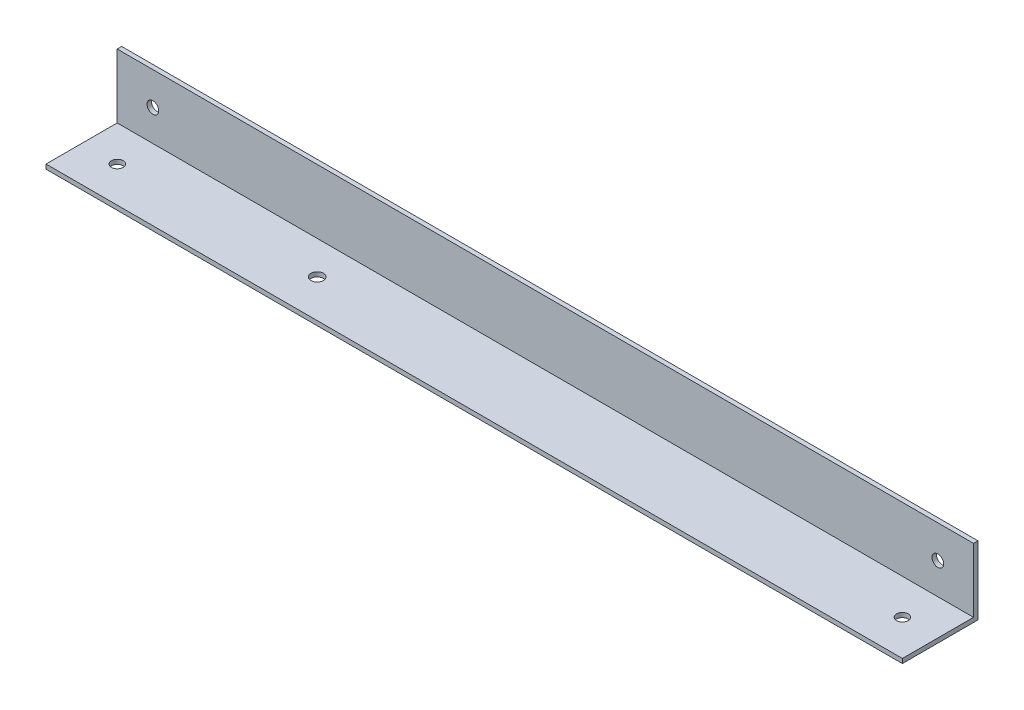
ISO-10303-21;
HEADER;
FILE_DESCRIPTION(('STEP AP214'),'2;1');
FILE_NAME('part.step','',(''),(''),'','','');
FILE_SCHEMA(('AUTOMOTIVE_DESIGN { 1 0 10303 214 1 1 1 1 }'));
ENDSEC;
DATA;
#1=APPLICATION_CONTEXT('core data for automotive mechanical design processes');
#2=APPLICATION_PROTOCOL_DEFINITION('international standard','automotive_design',2000,#1);
#3=PRODUCT_CONTEXT('',#1,'mechanical');
#4=PRODUCT('Part','Part','',(#3));
#5=PRODUCT_RELATED_PRODUCT_CATEGORY('part','',(#4));
#6=PRODUCT_DEFINITION_FORMATION('','',#4);
#7=PRODUCT_DEFINITION_CONTEXT('part definition',#1,'design');
#8=PRODUCT_DEFINITION('design','',#6,#7);
#9=PRODUCT_DEFINITION_SHAPE('','',#8);
#10=(LENGTH_UNIT() NAMED_UNIT(*) SI_UNIT(.MILLI.,.METRE.));
#11=(NAMED_UNIT(*) PLANE_ANGLE_UNIT() SI_UNIT($,.RADIAN.));
#12=(NAMED_UNIT(*) SI_UNIT($,.STERADIAN.) SOLID_ANGLE_UNIT());
#13=UNCERTAINTY_MEASURE_WITH_UNIT(LENGTH_MEASURE(1.E-05),#10,'distance_accuracy_value','');
#14=(GEOMETRIC_REPRESENTATION_CONTEXT(3) GLOBAL_UNCERTAINTY_ASSIGNED_CONTEXT((#13)) GLOBAL_UNIT_ASSIGNED_CONTEXT((#10,
#11,#12)) REPRESENTATION_CONTEXT('',''));
#15=CARTESIAN_POINT('',(0.,0.,0.));
#16=DIRECTION('',(0.,0.,1.));
#17=DIRECTION('',(1.,0.,0.));
#18=AXIS2_PLACEMENT_3D('',#15,#16,#17);
#19=CARTESIAN_POINT('',(0.,0.,26.924));
#20=DIRECTION('',(0.,0.,1.));
#21=DIRECTION('',(1.,0.,0.));
#22=AXIS2_PLACEMENT_3D('',#19,#20,#21);
#23=PLANE('',#22);
#24=DIRECTION('',(1.,0.,0.));
#25=VECTOR('',#24,1.);
#26=CARTESIAN_POINT('',(-209.826086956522,45.0420093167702,26.924));
#27=LINE('',#26,#25);
#28=CARTESIAN_POINT('',(-209.826086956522,45.0420093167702,26.924));
#29=VERTEX_POINT('',#28);
#30=CARTESIAN_POINT('',(94.9739130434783,45.0420093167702,26.924));
#31=VERTEX_POINT('',#30);
#32=EDGE_CURVE('E118',#29,#31,#27,.T.);
#33=ORIENTED_EDGE('',*,*,#32,.F.);
#34=DIRECTION('',(0.,-1.,0.));
#35=VECTOR('',#34,1.);
#36=CARTESIAN_POINT('',(-209.826086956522,67.8385093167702,26.924));
#37=LINE('',#36,#35);
#38=CARTESIAN_POINT('',(-209.826086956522,43.4545093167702,26.924));
#39=VERTEX_POINT('',#38);
#40=EDGE_CURVE('E95',#29,#39,#37,.T.);
#41=ORIENTED_EDGE('',*,*,#40,.T.);
#42=DIRECTION('',(1.,0.,0.));
#43=VECTOR('',#42,1.);
#44=CARTESIAN_POINT('',(-209.826086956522,43.4545093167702,26.924));
#45=LINE('',#44,#43);
#46=CARTESIAN_POINT('',(94.9739130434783,43.4545093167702,26.924));
#47=VERTEX_POINT('',#46);
#48=EDGE_CURVE('E57',#39,#47,#45,.T.);
#49=ORIENTED_EDGE('',*,*,#48,.T.);
#50=DIRECTION('',(0.,1.,0.));
#51=VECTOR('',#50,1.);
#52=CARTESIAN_POINT('',(94.9739130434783,67.8385093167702,26.924));
#53=LINE('',#52,#51);
#54=EDGE_CURVE('E88',#47,#31,#53,.T.);
#55=ORIENTED_EDGE('',*,*,#54,.T.);
#56=EDGE_LOOP('',(#33,#41,#49,#55));
#57=FACE_BOUND('',#56,.T.);
#58=ADVANCED_FACE('F38',(#57),#23,.T.);
#59=CARTESIAN_POINT('',(-209.826086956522,67.8385093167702,26.924));
#60=DIRECTION('',(1.,0.,0.));
#61=DIRECTION('',(0.,0.,-1.));
#62=AXIS2_PLACEMENT_3D('',#59,#60,#61);
#63=PLANE('',#62);
#64=DIRECTION('',(0.,0.,1.));
#65=VECTOR('',#64,1.);
#66=CARTESIAN_POINT('',(-209.826086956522,45.0420093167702,-303.37967743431));
#67=LINE('',#66,#65);
#68=CARTESIAN_POINT('',(-209.826086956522,45.0420093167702,1.58750000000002));
#69=VERTEX_POINT('',#68);
#70=EDGE_CURVE('E143',#69,#29,#67,.T.);
#71=ORIENTED_EDGE('',*,*,#70,.F.);
#72=DIRECTION('',(0.,1.,0.));
#73=VECTOR('',#72,1.);
#74=CARTESIAN_POINT('',(-209.826086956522,55.1385093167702,1.5875));
#75=LINE('',#74,#73);
#76=CARTESIAN_POINT('',(-209.826086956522,67.8385093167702,1.5875));
#77=VERTEX_POINT('',#76);
#78=EDGE_CURVE('E87',#69,#77,#75,.T.);
#79=ORIENTED_EDGE('',*,*,#78,.T.);
#80=DIRECTION('',(0.,0.,-1.));
#81=VECTOR('',#80,1.);
#82=CARTESIAN_POINT('',(-209.826086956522,67.8385093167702,26.924));
#83=LINE('',#82,#81);
#84=CARTESIAN_POINT('',(-209.826086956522,67.8385093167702,0.));
#85=VERTEX_POINT('',#84);
#86=EDGE_CURVE('E81',#77,#85,#83,.T.);
#87=ORIENTED_EDGE('',*,*,#86,.T.);
#88=DIRECTION('',(0.,-1.,0.));
#89=VECTOR('',#88,1.);
#90=CARTESIAN_POINT('',(-209.826086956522,67.8385093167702,0.));
#91=LINE('',#90,#89);
#92=CARTESIAN_POINT('',(-209.826086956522,43.4545093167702,0.));
#93=VERTEX_POINT('',#92);
#94=EDGE_CURVE('E85',#85,#93,#91,.T.);
#95=ORIENTED_EDGE('',*,*,#94,.T.);
#96=DIRECTION('',(0.,0.,-1.));
#97=VECTOR('',#96,1.);
#98=CARTESIAN_POINT('',(-209.826086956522,43.4545093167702,26.924));
#99=LINE('',#98,#97);
#100=EDGE_CURVE('E11',#39,#93,#99,.T.);
#101=ORIENTED_EDGE('',*,*,#100,.F.);
#102=ORIENTED_EDGE('',*,*,#40,.F.);
#103=EDGE_LOOP('',(#71,#79,#87,#95,#101,#102));
#104=FACE_BOUND('',#103,.T.);
#105=ADVANCED_FACE('F40',(#104),#63,.F.);
#106=CARTESIAN_POINT('',(-209.826086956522,43.4545093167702,26.924));
#107=DIRECTION('',(0.,1.,0.));
#108=DIRECTION('',(0.,0.,1.));
#109=AXIS2_PLACEMENT_3D('',#106,#107,#108);
#110=PLANE('',#109);
#111=CARTESIAN_POINT('',(-126.768086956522,43.4545093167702,13.462));
#112=DIRECTION('',(0.,-1.,0.));
#113=DIRECTION('',(0.,0.,-1.));
#114=AXIS2_PLACEMENT_3D('',#111,#112,#113);
#115=CIRCLE('',#114,2.2349968);
#116=CARTESIAN_POINT('',(-126.768086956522,43.4545093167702,11.2270032));
#117=VERTEX_POINT('',#116);
#118=EDGE_CURVE('E323',#117,#117,#115,.T.);
#119=ORIENTED_EDGE('',*,*,#118,.F.);
#120=EDGE_LOOP('',(#119));
#121=FACE_BOUND('',#120,.T.);
#122=CARTESIAN_POINT('',(-197.126086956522,43.4545093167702,14.224));
#123=DIRECTION('',(0.,-1.,0.));
#124=DIRECTION('',(0.,0.,-1.));
#125=AXIS2_PLACEMENT_3D('',#122,#123,#124);
#126=CIRCLE('',#125,2.08279999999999);
#127=CARTESIAN_POINT('',(-197.126086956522,43.4545093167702,12.1412));
#128=VERTEX_POINT('',#127);
#129=EDGE_CURVE('E122',#128,#128,#126,.T.);
#130=ORIENTED_EDGE('',*,*,#129,.F.);
#131=EDGE_LOOP('',(#130));
#132=FACE_BOUND('',#131,.T.);
#133=CARTESIAN_POINT('',(82.2739130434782,43.4545093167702,14.224));
#134=DIRECTION('',(0.,-1.,0.));
#135=DIRECTION('',(0.,0.,1.));
#136=AXIS2_PLACEMENT_3D('',#133,#134,#135);
#137=CIRCLE('',#136,2.0828);
#138=CARTESIAN_POINT('',(82.2739130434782,43.4545093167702,16.3068));
#139=VERTEX_POINT('',#138);
#140=EDGE_CURVE('E326',#139,#139,#137,.T.);
#141=ORIENTED_EDGE('',*,*,#140,.F.);
#142=EDGE_LOOP('',(#141));
#143=FACE_BOUND('',#142,.T.);
#144=DIRECTION('',(1.,0.,0.));
#145=VECTOR('',#144,1.);
#146=CARTESIAN_POINT('',(-209.826086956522,43.4545093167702,0.));
#147=LINE('',#146,#145);
#148=CARTESIAN_POINT('',(94.9739130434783,43.4545093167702,0.));
#149=VERTEX_POINT('',#148);
#150=EDGE_CURVE('E99',#93,#149,#147,.T.);
#151=ORIENTED_EDGE('',*,*,#150,.T.);
#152=DIRECTION('',(0.,0.,-1.));
#153=VECTOR('',#152,1.);
#154=CARTESIAN_POINT('',(94.9739130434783,43.4545093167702,26.924));
#155=LINE('',#154,#153);
#156=EDGE_CURVE('E48',#47,#149,#155,.T.);
#157=ORIENTED_EDGE('',*,*,#156,.F.);
#158=ORIENTED_EDGE('',*,*,#48,.F.);
#159=ORIENTED_EDGE('',*,*,#100,.T.);
#160=EDGE_LOOP('',(#151,#157,#158,#159));
#161=FACE_BOUND('',#160,.T.);
#162=ADVANCED_FACE('F174',(#121,#132,#143,#161),#110,.F.);
#163=CARTESIAN_POINT('',(94.9739130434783,67.8385093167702,26.924));
#164=DIRECTION('',(-1.,0.,0.));
#165=DIRECTION('',(0.,0.,1.));
#166=AXIS2_PLACEMENT_3D('',#163,#164,#165);
#167=PLANE('',#166);
#168=DIRECTION('',(0.,1.,0.));
#169=VECTOR('',#168,1.);
#170=CARTESIAN_POINT('',(94.9739130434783,55.1385093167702,1.5875));
#171=LINE('',#170,#169);
#172=CARTESIAN_POINT('',(94.9739130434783,45.0420093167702,1.58750000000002));
#173=VERTEX_POINT('',#172);
#174=CARTESIAN_POINT('',(94.9739130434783,67.8385093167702,1.5875));
#175=VERTEX_POINT('',#174);
#176=EDGE_CURVE('E102',#173,#175,#171,.T.);
#177=ORIENTED_EDGE('',*,*,#176,.F.);
#178=DIRECTION('',(0.,0.,1.));
#179=VECTOR('',#178,1.);
#180=CARTESIAN_POINT('',(94.9739130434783,45.0420093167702,-303.37967743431));
#181=LINE('',#180,#179);
#182=EDGE_CURVE('E140',#173,#31,#181,.T.);
#183=ORIENTED_EDGE('',*,*,#182,.T.);
#184=ORIENTED_EDGE('',*,*,#54,.F.);
#185=ORIENTED_EDGE('',*,*,#156,.T.);
#186=DIRECTION('',(0.,1.,0.));
#187=VECTOR('',#186,1.);
#188=CARTESIAN_POINT('',(94.9739130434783,67.8385093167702,0.));
#189=LINE('',#188,#187);
#190=CARTESIAN_POINT('',(94.9739130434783,67.8385093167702,0.));
#191=VERTEX_POINT('',#190);
#192=EDGE_CURVE('E96',#149,#191,#189,.T.);
#193=ORIENTED_EDGE('',*,*,#192,.T.);
#194=DIRECTION('',(0.,0.,-1.));
#195=VECTOR('',#194,1.);
#196=CARTESIAN_POINT('',(94.9739130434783,67.8385093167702,26.924));
#197=LINE('',#196,#195);
#198=EDGE_CURVE('E74',#175,#191,#197,.T.);
#199=ORIENTED_EDGE('',*,*,#198,.F.);
#200=EDGE_LOOP('',(#177,#183,#184,#185,#193,#199));
#201=FACE_BOUND('',#200,.T.);
#202=ADVANCED_FACE('F160',(#201),#167,.F.);
#203=CARTESIAN_POINT('',(-209.826086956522,67.8385093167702,26.924));
#204=DIRECTION('',(0.,-1.,0.));
#205=DIRECTION('',(0.,0.,-1.));
#206=AXIS2_PLACEMENT_3D('',#203,#204,#205);
#207=PLANE('',#206);
#208=ORIENTED_EDGE('',*,*,#86,.F.);
#209=DIRECTION('',(-1.,0.,0.));
#210=VECTOR('',#209,1.);
#211=CARTESIAN_POINT('',(-209.826086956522,67.8385093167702,1.5875));
#212=LINE('',#211,#210);
#213=EDGE_CURVE('E146',#175,#77,#212,.T.);
#214=ORIENTED_EDGE('',*,*,#213,.F.);
#215=ORIENTED_EDGE('',*,*,#198,.T.);
#216=DIRECTION('',(-1.,0.,0.));
#217=VECTOR('',#216,1.);
#218=CARTESIAN_POINT('',(-209.826086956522,67.8385093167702,0.));
#219=LINE('',#218,#217);
#220=EDGE_CURVE('E91',#191,#85,#219,.T.);
#221=ORIENTED_EDGE('',*,*,#220,.T.);
#222=EDGE_LOOP('',(#208,#214,#215,#221));
#223=FACE_BOUND('',#222,.T.);
#224=ADVANCED_FACE('F92',(#223),#207,.F.);
#225=CARTESIAN_POINT('',(0.,0.,0.));
#226=DIRECTION('',(0.,0.,1.));
#227=DIRECTION('',(1.,0.,0.));
#228=AXIS2_PLACEMENT_3D('',#225,#226,#227);
#229=PLANE('',#228);
#230=CARTESIAN_POINT('',(82.2739130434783,56.1545093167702,0.));
#231=DIRECTION('',(0.,0.,-1.));
#232=DIRECTION('',(-1.,0.,0.));
#233=AXIS2_PLACEMENT_3D('',#230,#231,#232);
#234=CIRCLE('',#233,2.0828);
#235=CARTESIAN_POINT('',(80.1911130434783,56.1545093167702,0.));
#236=VERTEX_POINT('',#235);
#237=EDGE_CURVE('E115',#236,#236,#234,.T.);
#238=ORIENTED_EDGE('',*,*,#237,.F.);
#239=EDGE_LOOP('',(#238));
#240=FACE_BOUND('',#239,.T.);
#241=CARTESIAN_POINT('',(-197.126086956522,56.1545093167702,0.));
#242=DIRECTION('',(0.,0.,-1.));
#243=DIRECTION('',(1.,0.,0.));
#244=AXIS2_PLACEMENT_3D('',#241,#242,#243);
#245=CIRCLE('',#244,2.08279999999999);
#246=CARTESIAN_POINT('',(-195.043286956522,56.1545093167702,0.));
#247=VERTEX_POINT('',#246);
#248=EDGE_CURVE('E124',#247,#247,#245,.T.);
#249=ORIENTED_EDGE('',*,*,#248,.F.);
#250=EDGE_LOOP('',(#249));
#251=FACE_BOUND('',#250,.T.);
#252=ORIENTED_EDGE('',*,*,#94,.F.);
#253=ORIENTED_EDGE('',*,*,#220,.F.);
#254=ORIENTED_EDGE('',*,*,#192,.F.);
#255=ORIENTED_EDGE('',*,*,#150,.F.);
#256=EDGE_LOOP('',(#252,#253,#254,#255));
#257=FACE_BOUND('',#256,.T.);
#258=ADVANCED_FACE('F98',(#240,#251,#257),#229,.F.);
#259=CARTESIAN_POINT('',(-209.826086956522,55.1385093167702,1.5875));
#260=DIRECTION('',(0.,0.,-1.));
#261=DIRECTION('',(-1.,0.,0.));
#262=AXIS2_PLACEMENT_3D('',#259,#260,#261);
#263=PLANE('',#262);
#264=CARTESIAN_POINT('',(82.2739130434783,56.1545093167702,1.5875));
#265=DIRECTION('',(0.,0.,-1.));
#266=DIRECTION('',(-1.,0.,0.));
#267=AXIS2_PLACEMENT_3D('',#264,#265,#266);
#268=CIRCLE('',#267,2.0828);
#269=CARTESIAN_POINT('',(80.1911130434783,56.1545093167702,1.5875));
#270=VERTEX_POINT('',#269);
#271=EDGE_CURVE('E114',#270,#270,#268,.T.);
#272=ORIENTED_EDGE('',*,*,#271,.T.);
#273=EDGE_LOOP('',(#272));
#274=FACE_BOUND('',#273,.T.);
#275=CARTESIAN_POINT('',(-197.126086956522,56.1545093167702,1.5875));
#276=DIRECTION('',(0.,0.,-1.));
#277=DIRECTION('',(-1.,0.,0.));
#278=AXIS2_PLACEMENT_3D('',#275,#276,#277);
#279=CIRCLE('',#278,2.08279999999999);
#280=CARTESIAN_POINT('',(-199.208886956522,56.1545093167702,1.5875));
#281=VERTEX_POINT('',#280);
#282=EDGE_CURVE('E111',#281,#281,#279,.T.);
#283=ORIENTED_EDGE('',*,*,#282,.T.);
#284=EDGE_LOOP('',(#283));
#285=FACE_BOUND('',#284,.T.);
#286=ORIENTED_EDGE('',*,*,#213,.T.);
#287=ORIENTED_EDGE('',*,*,#78,.F.);
#288=DIRECTION('',(1.,0.,0.));
#289=VECTOR('',#288,1.);
#290=CARTESIAN_POINT('',(-209.826086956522,45.0420093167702,1.58750000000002));
#291=LINE('',#290,#289);
#292=EDGE_CURVE('E137',#69,#173,#291,.T.);
#293=ORIENTED_EDGE('',*,*,#292,.T.);
#294=ORIENTED_EDGE('',*,*,#176,.T.);
#295=EDGE_LOOP('',(#286,#287,#293,#294));
#296=FACE_BOUND('',#295,.T.);
#297=ADVANCED_FACE('F168',(#274,#285,#296),#263,.F.);
#298=CARTESIAN_POINT('',(-209.826086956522,45.0420093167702,-303.37967743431));
#299=DIRECTION('',(0.,-1.,0.));
#300=DIRECTION('',(0.,0.,-1.));
#301=AXIS2_PLACEMENT_3D('',#298,#299,#300);
#302=PLANE('',#301);
#303=CARTESIAN_POINT('',(-126.768086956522,45.0420093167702,13.462));
#304=DIRECTION('',(0.,-1.,0.));
#305=DIRECTION('',(0.,0.,-1.));
#306=AXIS2_PLACEMENT_3D('',#303,#304,#305);
#307=CIRCLE('',#306,2.2349968);
#308=CARTESIAN_POINT('',(-126.768086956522,45.0420093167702,11.2270032));
#309=VERTEX_POINT('',#308);
#310=EDGE_CURVE('E42',#309,#309,#307,.T.);
#311=ORIENTED_EDGE('',*,*,#310,.T.);
#312=EDGE_LOOP('',(#311));
#313=FACE_BOUND('',#312,.T.);
#314=CARTESIAN_POINT('',(-197.126086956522,45.0420093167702,14.224));
#315=DIRECTION('',(0.,-1.,0.));
#316=DIRECTION('',(0.,0.,-1.));
#317=AXIS2_PLACEMENT_3D('',#314,#315,#316);
#318=CIRCLE('',#317,2.08279999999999);
#319=CARTESIAN_POINT('',(-197.126086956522,45.0420093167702,12.1412));
#320=VERTEX_POINT('',#319);
#321=EDGE_CURVE('E121',#320,#320,#318,.T.);
#322=ORIENTED_EDGE('',*,*,#321,.T.);
#323=EDGE_LOOP('',(#322));
#324=FACE_BOUND('',#323,.T.);
#325=CARTESIAN_POINT('',(82.2739130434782,45.0420093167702,14.224));
#326=DIRECTION('',(0.,-1.,0.));
#327=DIRECTION('',(0.,0.,-1.));
#328=AXIS2_PLACEMENT_3D('',#325,#326,#327);
#329=CIRCLE('',#328,2.0828);
#330=CARTESIAN_POINT('',(82.2739130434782,45.0420093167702,12.1412));
#331=VERTEX_POINT('',#330);
#332=EDGE_CURVE('E119',#331,#331,#329,.T.);
#333=ORIENTED_EDGE('',*,*,#332,.T.);
#334=EDGE_LOOP('',(#333));
#335=FACE_BOUND('',#334,.T.);
#336=ORIENTED_EDGE('',*,*,#70,.T.);
#337=ORIENTED_EDGE('',*,*,#32,.T.);
#338=ORIENTED_EDGE('',*,*,#182,.F.);
#339=ORIENTED_EDGE('',*,*,#292,.F.);
#340=EDGE_LOOP('',(#336,#337,#338,#339));
#341=FACE_BOUND('',#340,.T.);
#342=ADVANCED_FACE('F165',(#313,#324,#335,#341),#302,.F.);
#343=CARTESIAN_POINT('',(-197.126086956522,56.1545093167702,2.54));
#344=DIRECTION('',(0.,0.,-1.));
#345=DIRECTION('',(-1.,0.,0.));
#346=AXIS2_PLACEMENT_3D('',#343,#344,#345);
#347=CYLINDRICAL_SURFACE('',#346,2.08279999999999);
#348=ORIENTED_EDGE('',*,*,#248,.T.);
#349=EDGE_LOOP('',(#348));
#350=FACE_BOUND('',#349,.T.);
#351=ORIENTED_EDGE('',*,*,#282,.F.);
#352=EDGE_LOOP('',(#351));
#353=FACE_BOUND('',#352,.T.);
#354=ADVANCED_FACE('F216',(#350,#353),#347,.F.);
#355=CARTESIAN_POINT('',(82.2739130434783,56.1545093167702,2.54));
#356=DIRECTION('',(0.,0.,-1.));
#357=DIRECTION('',(-1.,0.,0.));
#358=AXIS2_PLACEMENT_3D('',#355,#356,#357);
#359=CYLINDRICAL_SURFACE('',#358,2.0828);
#360=ORIENTED_EDGE('',*,*,#237,.T.);
#361=EDGE_LOOP('',(#360));
#362=FACE_BOUND('',#361,.T.);
#363=ORIENTED_EDGE('',*,*,#271,.F.);
#364=EDGE_LOOP('',(#363));
#365=FACE_BOUND('',#364,.T.);
#366=ADVANCED_FACE('F223',(#362,#365),#359,.F.);
#367=CARTESIAN_POINT('',(82.2739130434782,45.9945093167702,14.224));
#368=DIRECTION('',(0.,-1.,0.));
#369=DIRECTION('',(0.,0.,-1.));
#370=AXIS2_PLACEMENT_3D('',#367,#368,#369);
#371=CYLINDRICAL_SURFACE('',#370,2.0828);
#372=ORIENTED_EDGE('',*,*,#140,.T.);
#373=EDGE_LOOP('',(#372));
#374=FACE_BOUND('',#373,.T.);
#375=ORIENTED_EDGE('',*,*,#332,.F.);
#376=EDGE_LOOP('',(#375));
#377=FACE_BOUND('',#376,.T.);
#378=ADVANCED_FACE('F230',(#374,#377),#371,.F.);
#379=CARTESIAN_POINT('',(-197.126086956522,45.9945093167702,14.224));
#380=DIRECTION('',(0.,-1.,0.));
#381=DIRECTION('',(0.,0.,-1.));
#382=AXIS2_PLACEMENT_3D('',#379,#380,#381);
#383=CYLINDRICAL_SURFACE('',#382,2.08279999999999);
#384=ORIENTED_EDGE('',*,*,#129,.T.);
#385=EDGE_LOOP('',(#384));
#386=FACE_BOUND('',#385,.T.);
#387=ORIENTED_EDGE('',*,*,#321,.F.);
#388=EDGE_LOOP('',(#387));
#389=FACE_BOUND('',#388,.T.);
#390=ADVANCED_FACE('F238',(#386,#389),#383,.F.);
#391=CARTESIAN_POINT('',(-126.768086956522,45.9945093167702,13.462));
#392=DIRECTION('',(0.,-1.,0.));
#393=DIRECTION('',(0.,0.,-1.));
#394=AXIS2_PLACEMENT_3D('',#391,#392,#393);
#395=CYLINDRICAL_SURFACE('',#394,2.2349968);
#396=ORIENTED_EDGE('',*,*,#118,.T.);
#397=EDGE_LOOP('',(#396));
#398=FACE_BOUND('',#397,.T.);
#399=ORIENTED_EDGE('',*,*,#310,.F.);
#400=EDGE_LOOP('',(#399));
#401=FACE_BOUND('',#400,.T.);
#402=ADVANCED_FACE('F246',(#398,#401),#395,.F.);
#403=CLOSED_SHELL('',(#58,#105,#162,#202,#224,#258,#297,#342,#354,#366,#378,#390,#402));
#404=MANIFOLD_SOLID_BREP('B2',#403);
#405=ADVANCED_BREP_SHAPE_REPRESENTATION('',(#18,#404),#14);
#406=SHAPE_DEFINITION_REPRESENTATION(#9,#405);
ENDSEC;
END-ISO-10303-21;
